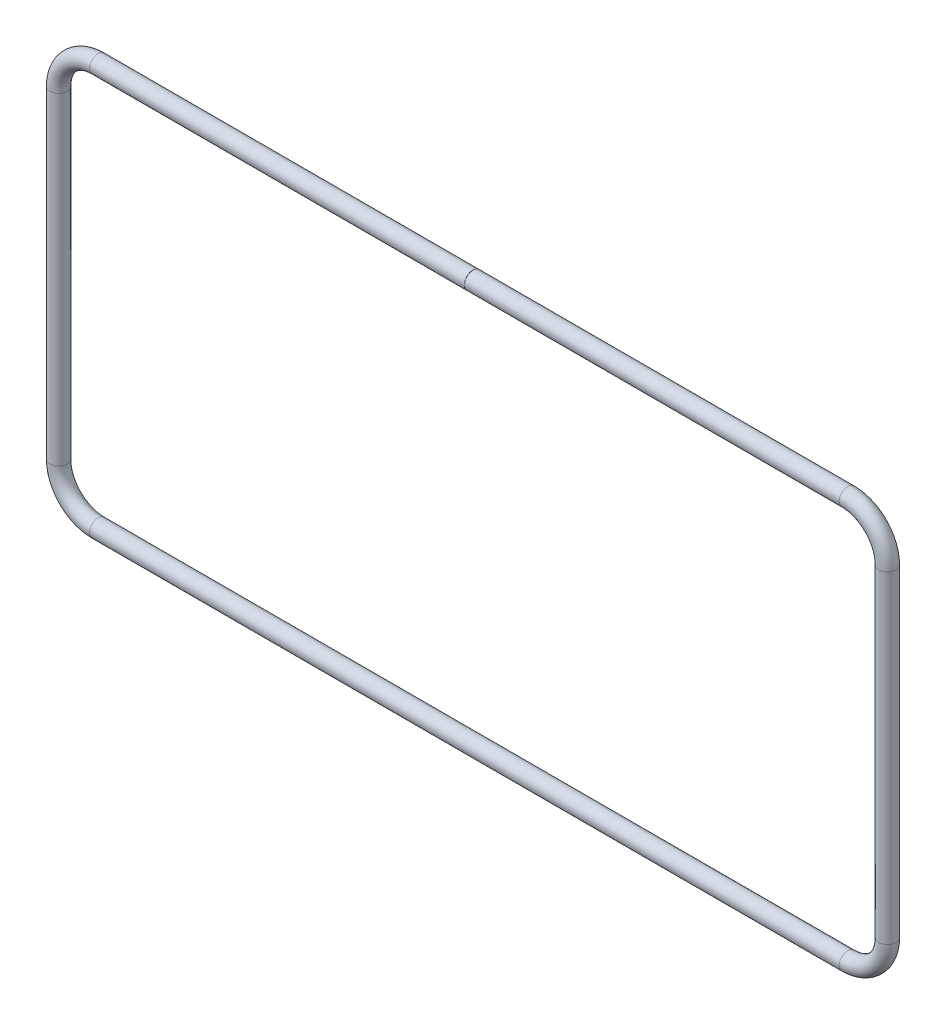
from build123d import *

# Parameters (mm, degrees)
SKETCH2_R = 1.7653


with BuildPart() as part:
    # Base-Sweep: sweep along a path in Sketch1
    with BuildLine(Plane.XY) as base_sweep_path:
        Line((0, 41.2623), (-76.9493, 41.2623))
        ThreePointArc((-76.9493, 41.2623), (-82.696663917, 38.881663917), (-85.0773, 33.1343))
        Line((-85.0773, 33.1343), (-85.0773, -33.1343))
        ThreePointArc((-85.0773, -33.1343), (-82.696663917, -38.881663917), (-76.9493, -41.2623))
        Line((-76.9493, -41.2623), (76.9493, -41.2623))
        ThreePointArc((76.9493, -41.2623), (82.696663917, -38.881663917), (85.0773, -33.1343))
        Line((85.0773, -33.1343), (85.0773, 33.1343))
        ThreePointArc((85.0773, 33.1343), (82.696663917, 38.881663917), (76.9493, 41.2623))
        Line((76.9493, 41.2623), (0.0254, 41.2623))
    # Sketch2 → Base-Sweep (sweep)
    with BuildSketch(Plane(origin=(0, 41.2623, 0), x_dir=(0, 0, -1), z_dir=(1, 0, 0))):
        Circle(SKETCH2_R)
    sweep(path=base_sweep_path.line)


solid = part.part
